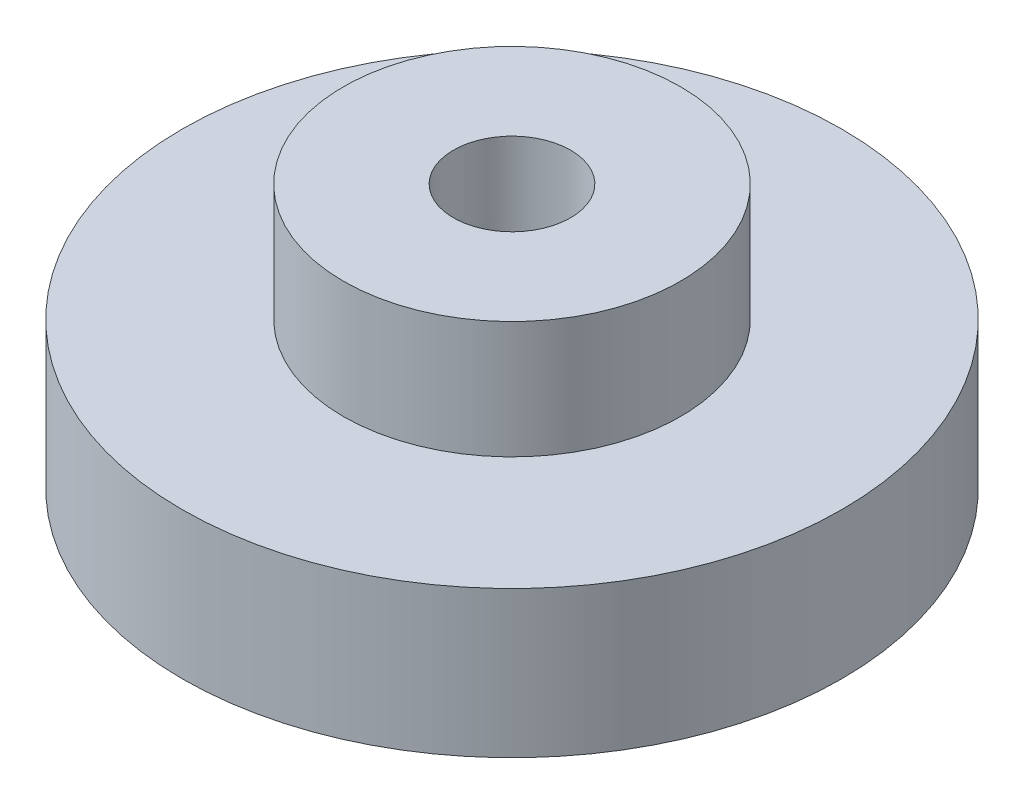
ISO-10303-21;
HEADER;
FILE_DESCRIPTION(('STEP AP214'),'2;1');
FILE_NAME('part.step','',(''),(''),'','','');
FILE_SCHEMA(('AUTOMOTIVE_DESIGN { 1 0 10303 214 1 1 1 1 }'));
ENDSEC;
DATA;
#1=APPLICATION_CONTEXT('core data for automotive mechanical design processes');
#2=APPLICATION_PROTOCOL_DEFINITION('international standard','automotive_design',2000,#1);
#3=PRODUCT_CONTEXT('',#1,'mechanical');
#4=PRODUCT('Part','Part','',(#3));
#5=PRODUCT_RELATED_PRODUCT_CATEGORY('part','',(#4));
#6=PRODUCT_DEFINITION_FORMATION('','',#4);
#7=PRODUCT_DEFINITION_CONTEXT('part definition',#1,'design');
#8=PRODUCT_DEFINITION('design','',#6,#7);
#9=PRODUCT_DEFINITION_SHAPE('','',#8);
#10=(LENGTH_UNIT() NAMED_UNIT(*) SI_UNIT(.MILLI.,.METRE.));
#11=(NAMED_UNIT(*) PLANE_ANGLE_UNIT() SI_UNIT($,.RADIAN.));
#12=(NAMED_UNIT(*) SI_UNIT($,.STERADIAN.) SOLID_ANGLE_UNIT());
#13=UNCERTAINTY_MEASURE_WITH_UNIT(LENGTH_MEASURE(1.E-05),#10,'distance_accuracy_value','');
#14=(GEOMETRIC_REPRESENTATION_CONTEXT(3) GLOBAL_UNCERTAINTY_ASSIGNED_CONTEXT((#13)) GLOBAL_UNIT_ASSIGNED_CONTEXT((#10,
#11,#12)) REPRESENTATION_CONTEXT('',''));
#15=CARTESIAN_POINT('',(0.,0.,0.));
#16=DIRECTION('',(0.,0.,1.));
#17=DIRECTION('',(1.,0.,0.));
#18=AXIS2_PLACEMENT_3D('',#15,#16,#17);
#19=CARTESIAN_POINT('',(0.,10.,0.));
#20=DIRECTION('',(0.,-1.,0.));
#21=DIRECTION('',(0.,0.,-1.));
#22=AXIS2_PLACEMENT_3D('',#19,#20,#21);
#23=CYLINDRICAL_SURFACE('',#22,22.5);
#24=CARTESIAN_POINT('',(0.,10.,0.));
#25=DIRECTION('',(0.,1.,0.));
#26=DIRECTION('',(0.,0.,1.));
#27=AXIS2_PLACEMENT_3D('',#24,#25,#26);
#28=CIRCLE('',#27,22.5);
#29=CARTESIAN_POINT('',(0.,10.,22.5));
#30=VERTEX_POINT('',#29);
#31=EDGE_CURVE('E10',#30,#30,#28,.T.);
#32=ORIENTED_EDGE('',*,*,#31,.F.);
#33=EDGE_LOOP('',(#32));
#34=FACE_BOUND('',#33,.T.);
#35=CARTESIAN_POINT('',(0.,0.,0.));
#36=DIRECTION('',(0.,1.,0.));
#37=DIRECTION('',(0.,0.,1.));
#38=AXIS2_PLACEMENT_3D('',#35,#36,#37);
#39=CIRCLE('',#38,22.5);
#40=CARTESIAN_POINT('',(0.,0.,22.5));
#41=VERTEX_POINT('',#40);
#42=EDGE_CURVE('E34',#41,#41,#39,.T.);
#43=ORIENTED_EDGE('',*,*,#42,.T.);
#44=EDGE_LOOP('',(#43));
#45=FACE_BOUND('',#44,.T.);
#46=ADVANCED_FACE('F31',(#34,#45),#23,.T.);
#47=CARTESIAN_POINT('',(0.,10.,0.));
#48=DIRECTION('',(0.,1.,0.));
#49=DIRECTION('',(0.,0.,1.));
#50=AXIS2_PLACEMENT_3D('',#47,#48,#49);
#51=PLANE('',#50);
#52=CARTESIAN_POINT('',(0.,10.,0.));
#53=DIRECTION('',(0.,1.,0.));
#54=DIRECTION('',(0.,0.,1.));
#55=AXIS2_PLACEMENT_3D('',#52,#53,#54);
#56=CIRCLE('',#55,11.5);
#57=CARTESIAN_POINT('',(0.,10.,11.5));
#58=VERTEX_POINT('',#57);
#59=EDGE_CURVE('E43',#58,#58,#56,.T.);
#60=ORIENTED_EDGE('',*,*,#59,.F.);
#61=EDGE_LOOP('',(#60));
#62=FACE_BOUND('',#61,.T.);
#63=ORIENTED_EDGE('',*,*,#31,.T.);
#64=EDGE_LOOP('',(#63));
#65=FACE_BOUND('',#64,.T.);
#66=ADVANCED_FACE('F68',(#62,#65),#51,.T.);
#67=CARTESIAN_POINT('',(0.,0.,0.));
#68=DIRECTION('',(0.,1.,0.));
#69=DIRECTION('',(0.,0.,1.));
#70=AXIS2_PLACEMENT_3D('',#67,#68,#69);
#71=PLANE('',#70);
#72=CARTESIAN_POINT('',(0.,0.,0.));
#73=DIRECTION('',(0.,1.,0.));
#74=DIRECTION('',(0.,0.,1.));
#75=AXIS2_PLACEMENT_3D('',#72,#73,#74);
#76=CIRCLE('',#75,4.);
#77=CARTESIAN_POINT('',(0.,0.,4.));
#78=VERTEX_POINT('',#77);
#79=EDGE_CURVE('E46',#78,#78,#76,.T.);
#80=ORIENTED_EDGE('',*,*,#79,.T.);
#81=EDGE_LOOP('',(#80));
#82=FACE_BOUND('',#81,.T.);
#83=ORIENTED_EDGE('',*,*,#42,.F.);
#84=EDGE_LOOP('',(#83));
#85=FACE_BOUND('',#84,.T.);
#86=ADVANCED_FACE('F64',(#82,#85),#71,.F.);
#87=CARTESIAN_POINT('',(0.,18.,0.));
#88=DIRECTION('',(0.,-1.,0.));
#89=DIRECTION('',(0.,0.,-1.));
#90=AXIS2_PLACEMENT_3D('',#87,#88,#89);
#91=CYLINDRICAL_SURFACE('',#90,11.5);
#92=CARTESIAN_POINT('',(0.,18.,0.));
#93=DIRECTION('',(0.,1.,0.));
#94=DIRECTION('',(0.,0.,1.));
#95=AXIS2_PLACEMENT_3D('',#92,#93,#94);
#96=CIRCLE('',#95,11.5);
#97=CARTESIAN_POINT('',(0.,18.,11.5));
#98=VERTEX_POINT('',#97);
#99=EDGE_CURVE('E41',#98,#98,#96,.T.);
#100=ORIENTED_EDGE('',*,*,#99,.F.);
#101=EDGE_LOOP('',(#100));
#102=FACE_BOUND('',#101,.T.);
#103=ORIENTED_EDGE('',*,*,#59,.T.);
#104=EDGE_LOOP('',(#103));
#105=FACE_BOUND('',#104,.T.);
#106=ADVANCED_FACE('F67',(#102,#105),#91,.T.);
#107=CARTESIAN_POINT('',(0.,18.,0.));
#108=DIRECTION('',(0.,1.,0.));
#109=DIRECTION('',(0.,0.,1.));
#110=AXIS2_PLACEMENT_3D('',#107,#108,#109);
#111=PLANE('',#110);
#112=CARTESIAN_POINT('',(0.,18.,0.));
#113=DIRECTION('',(0.,-1.,0.));
#114=DIRECTION('',(0.,0.,-1.));
#115=AXIS2_PLACEMENT_3D('',#112,#113,#114);
#116=CIRCLE('',#115,4.);
#117=CARTESIAN_POINT('',(0.,18.,-4.));
#118=VERTEX_POINT('',#117);
#119=EDGE_CURVE('E51',#118,#118,#116,.T.);
#120=ORIENTED_EDGE('',*,*,#119,.T.);
#121=EDGE_LOOP('',(#120));
#122=FACE_BOUND('',#121,.T.);
#123=ORIENTED_EDGE('',*,*,#99,.T.);
#124=EDGE_LOOP('',(#123));
#125=FACE_BOUND('',#124,.T.);
#126=ADVANCED_FACE('F55',(#122,#125),#111,.T.);
#127=CARTESIAN_POINT('',(0.,18.,0.));
#128=DIRECTION('',(0.,-1.,0.));
#129=DIRECTION('',(0.,0.,-1.));
#130=AXIS2_PLACEMENT_3D('',#127,#128,#129);
#131=CYLINDRICAL_SURFACE('',#130,4.);
#132=ORIENTED_EDGE('',*,*,#119,.F.);
#133=EDGE_LOOP('',(#132));
#134=FACE_BOUND('',#133,.T.);
#135=ORIENTED_EDGE('',*,*,#79,.F.);
#136=EDGE_LOOP('',(#135));
#137=FACE_BOUND('',#136,.T.);
#138=ADVANCED_FACE('F58',(#134,#137),#131,.F.);
#139=CLOSED_SHELL('',(#46,#66,#86,#106,#126,#138));
#140=MANIFOLD_SOLID_BREP('B2',#139);
#141=ADVANCED_BREP_SHAPE_REPRESENTATION('',(#18,#140),#14);
#142=SHAPE_DEFINITION_REPRESENTATION(#9,#141);
ENDSEC;
END-ISO-10303-21;
